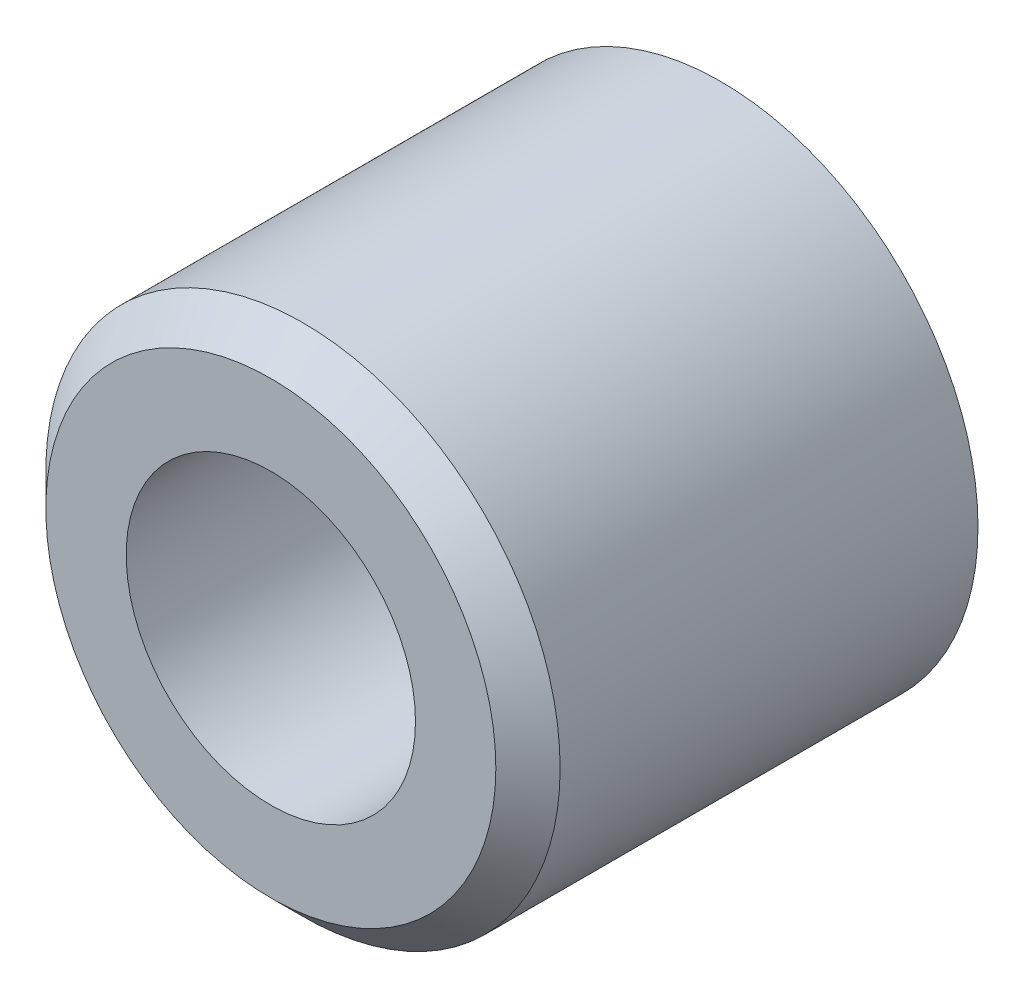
ISO-10303-21;
HEADER;
FILE_DESCRIPTION(('STEP AP214'),'2;1');
FILE_NAME('part.step','',(''),(''),'','','');
FILE_SCHEMA(('AUTOMOTIVE_DESIGN { 1 0 10303 214 1 1 1 1 }'));
ENDSEC;
DATA;
#1=APPLICATION_CONTEXT('core data for automotive mechanical design processes');
#2=APPLICATION_PROTOCOL_DEFINITION('international standard','automotive_design',2000,#1);
#3=PRODUCT_CONTEXT('',#1,'mechanical');
#4=PRODUCT('Part','Part','',(#3));
#5=PRODUCT_RELATED_PRODUCT_CATEGORY('part','',(#4));
#6=PRODUCT_DEFINITION_FORMATION('','',#4);
#7=PRODUCT_DEFINITION_CONTEXT('part definition',#1,'design');
#8=PRODUCT_DEFINITION('design','',#6,#7);
#9=PRODUCT_DEFINITION_SHAPE('','',#8);
#10=(LENGTH_UNIT() NAMED_UNIT(*) SI_UNIT(.MILLI.,.METRE.));
#11=(NAMED_UNIT(*) PLANE_ANGLE_UNIT() SI_UNIT($,.RADIAN.));
#12=(NAMED_UNIT(*) SI_UNIT($,.STERADIAN.) SOLID_ANGLE_UNIT());
#13=UNCERTAINTY_MEASURE_WITH_UNIT(LENGTH_MEASURE(1.E-05),#10,'distance_accuracy_value','');
#14=(GEOMETRIC_REPRESENTATION_CONTEXT(3) GLOBAL_UNCERTAINTY_ASSIGNED_CONTEXT((#13)) GLOBAL_UNIT_ASSIGNED_CONTEXT((#10,
#11,#12)) REPRESENTATION_CONTEXT('',''));
#15=CARTESIAN_POINT('',(0.,0.,0.));
#16=DIRECTION('',(0.,0.,1.));
#17=DIRECTION('',(1.,0.,0.));
#18=AXIS2_PLACEMENT_3D('',#15,#16,#17);
#19=CARTESIAN_POINT('',(0.,0.,7.));
#20=DIRECTION('',(0.,0.,1.));
#21=DIRECTION('',(1.,0.,0.));
#22=AXIS2_PLACEMENT_3D('',#19,#20,#21);
#23=PLANE('',#22);
#24=CARTESIAN_POINT('',(0.,0.,7.));
#25=DIRECTION('',(0.,0.,1.));
#26=DIRECTION('',(1.,0.,0.));
#27=AXIS2_PLACEMENT_3D('',#24,#25,#26);
#28=CIRCLE('',#27,3.5);
#29=CARTESIAN_POINT('',(3.5,0.,7.));
#30=VERTEX_POINT('',#29);
#31=EDGE_CURVE('E41',#30,#30,#28,.T.);
#32=ORIENTED_EDGE('',*,*,#31,.T.);
#33=EDGE_LOOP('',(#32));
#34=FACE_BOUND('',#33,.T.);
#35=CARTESIAN_POINT('',(0.,0.,7.));
#36=DIRECTION('',(0.,0.,1.));
#37=DIRECTION('',(1.,0.,0.));
#38=AXIS2_PLACEMENT_3D('',#35,#36,#37);
#39=CIRCLE('',#38,2.25);
#40=CARTESIAN_POINT('',(2.25,0.,7.));
#41=VERTEX_POINT('',#40);
#42=EDGE_CURVE('E49',#41,#41,#39,.T.);
#43=ORIENTED_EDGE('',*,*,#42,.F.);
#44=EDGE_LOOP('',(#43));
#45=FACE_BOUND('',#44,.T.);
#46=ADVANCED_FACE('F33',(#34,#45),#23,.T.);
#47=CARTESIAN_POINT('',(0.,0.,0.));
#48=DIRECTION('',(0.,0.,1.));
#49=DIRECTION('',(1.,0.,0.));
#50=AXIS2_PLACEMENT_3D('',#47,#48,#49);
#51=PLANE('',#50);
#52=CARTESIAN_POINT('',(0.,0.,0.));
#53=DIRECTION('',(0.,0.,1.));
#54=DIRECTION('',(1.,0.,0.));
#55=AXIS2_PLACEMENT_3D('',#52,#53,#54);
#56=CIRCLE('',#55,4.);
#57=CARTESIAN_POINT('',(4.,0.,0.));
#58=VERTEX_POINT('',#57);
#59=EDGE_CURVE('E45',#58,#58,#56,.T.);
#60=ORIENTED_EDGE('',*,*,#59,.F.);
#61=EDGE_LOOP('',(#60));
#62=FACE_BOUND('',#61,.T.);
#63=CARTESIAN_POINT('',(0.,0.,0.));
#64=DIRECTION('',(0.,0.,1.));
#65=DIRECTION('',(1.,0.,0.));
#66=AXIS2_PLACEMENT_3D('',#63,#64,#65);
#67=CIRCLE('',#66,2.25);
#68=CARTESIAN_POINT('',(2.25,0.,0.));
#69=VERTEX_POINT('',#68);
#70=EDGE_CURVE('E52',#69,#69,#67,.T.);
#71=ORIENTED_EDGE('',*,*,#70,.T.);
#72=EDGE_LOOP('',(#71));
#73=FACE_BOUND('',#72,.T.);
#74=ADVANCED_FACE('F62',(#62,#73),#51,.F.);
#75=CARTESIAN_POINT('',(0.,0.,7.));
#76=DIRECTION('',(0.,0.,-1.));
#77=DIRECTION('',(-1.,0.,0.));
#78=AXIS2_PLACEMENT_3D('',#75,#76,#77);
#79=CYLINDRICAL_SURFACE('',#78,4.);
#80=CARTESIAN_POINT('',(0.,0.,6.5));
#81=DIRECTION('',(0.,0.,1.));
#82=DIRECTION('',(1.,0.,0.));
#83=AXIS2_PLACEMENT_3D('',#80,#81,#82);
#84=CIRCLE('',#83,4.);
#85=CARTESIAN_POINT('',(4.,0.,6.5));
#86=VERTEX_POINT('',#85);
#87=EDGE_CURVE('E10',#86,#86,#84,.F.);
#88=ORIENTED_EDGE('',*,*,#87,.T.);
#89=EDGE_LOOP('',(#88));
#90=FACE_BOUND('',#89,.T.);
#91=ORIENTED_EDGE('',*,*,#59,.T.);
#92=EDGE_LOOP('',(#91));
#93=FACE_BOUND('',#92,.T.);
#94=ADVANCED_FACE('F67',(#90,#93),#79,.T.);
#95=CARTESIAN_POINT('',(0.,0.,7.));
#96=DIRECTION('',(0.,0.,-1.));
#97=DIRECTION('',(-1.,0.,0.));
#98=AXIS2_PLACEMENT_3D('',#95,#96,#97);
#99=CYLINDRICAL_SURFACE('',#98,2.25);
#100=ORIENTED_EDGE('',*,*,#42,.T.);
#101=EDGE_LOOP('',(#100));
#102=FACE_BOUND('',#101,.T.);
#103=ORIENTED_EDGE('',*,*,#70,.F.);
#104=EDGE_LOOP('',(#103));
#105=FACE_BOUND('',#104,.T.);
#106=ADVANCED_FACE('F58',(#102,#105),#99,.F.);
#107=CARTESIAN_POINT('',(0.,0.,7.));
#108=DIRECTION('',(0.,0.,-1.));
#109=DIRECTION('',(-1.,0.,0.));
#110=AXIS2_PLACEMENT_3D('',#107,#108,#109);
#111=CONICAL_SURFACE('',#110,3.5,0.785398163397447);
#112=ORIENTED_EDGE('',*,*,#87,.F.);
#113=EDGE_LOOP('',(#112));
#114=FACE_BOUND('',#113,.T.);
#115=ORIENTED_EDGE('',*,*,#31,.F.);
#116=EDGE_LOOP('',(#115));
#117=FACE_BOUND('',#116,.T.);
#118=ADVANCED_FACE('F36',(#114,#117),#111,.T.);
#119=CLOSED_SHELL('',(#46,#74,#94,#106,#118));
#120=MANIFOLD_SOLID_BREP('B2',#119);
#121=ADVANCED_BREP_SHAPE_REPRESENTATION('',(#18,#120),#14);
#122=SHAPE_DEFINITION_REPRESENTATION(#9,#121);
ENDSEC;
END-ISO-10303-21;
